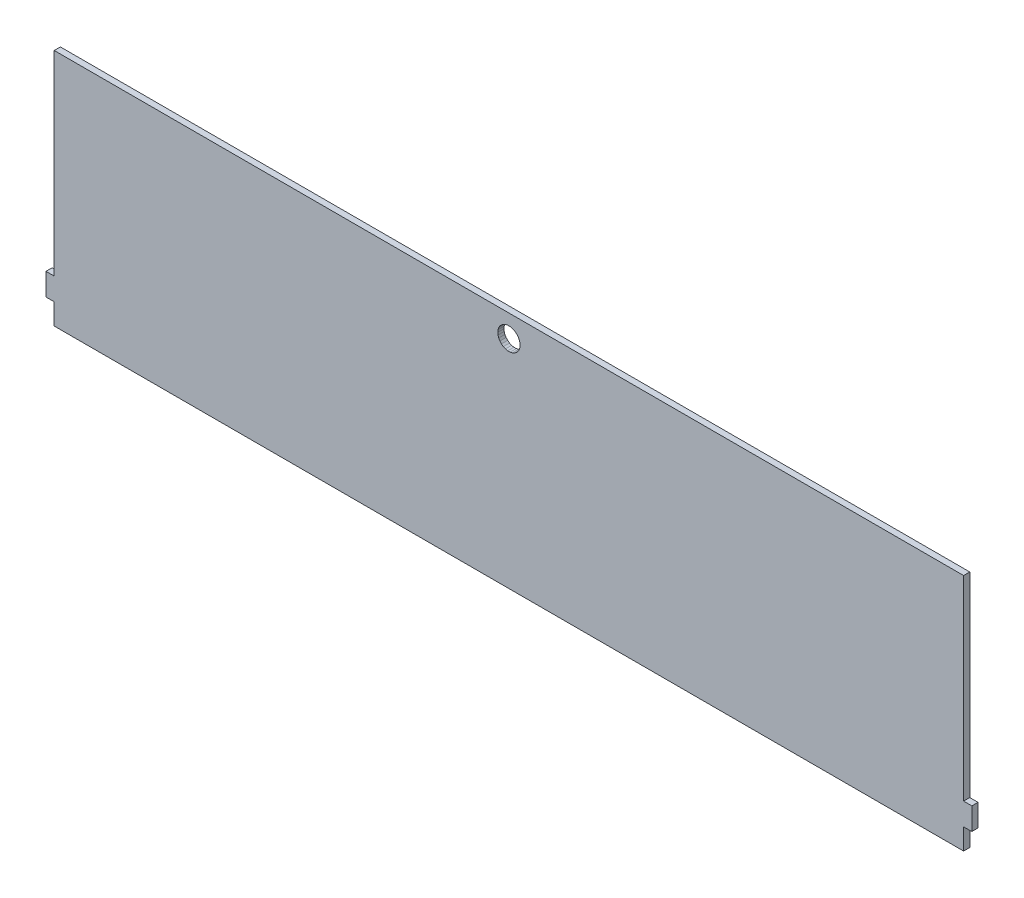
ISO-10303-21;
HEADER;
FILE_DESCRIPTION(('STEP AP214'),'2;1');
FILE_NAME('part.step','',(''),(''),'','','');
FILE_SCHEMA(('AUTOMOTIVE_DESIGN { 1 0 10303 214 1 1 1 1 }'));
ENDSEC;
DATA;
#1=APPLICATION_CONTEXT('core data for automotive mechanical design processes');
#2=APPLICATION_PROTOCOL_DEFINITION('international standard','automotive_design',2000,#1);
#3=PRODUCT_CONTEXT('',#1,'mechanical');
#4=PRODUCT('Part','Part','',(#3));
#5=PRODUCT_RELATED_PRODUCT_CATEGORY('part','',(#4));
#6=PRODUCT_DEFINITION_FORMATION('','',#4);
#7=PRODUCT_DEFINITION_CONTEXT('part definition',#1,'design');
#8=PRODUCT_DEFINITION('design','',#6,#7);
#9=PRODUCT_DEFINITION_SHAPE('','',#8);
#10=(LENGTH_UNIT() NAMED_UNIT(*) SI_UNIT(.MILLI.,.METRE.));
#11=(NAMED_UNIT(*) PLANE_ANGLE_UNIT() SI_UNIT($,.RADIAN.));
#12=(NAMED_UNIT(*) SI_UNIT($,.STERADIAN.) SOLID_ANGLE_UNIT());
#13=UNCERTAINTY_MEASURE_WITH_UNIT(LENGTH_MEASURE(1.E-05),#10,'distance_accuracy_value','');
#14=(GEOMETRIC_REPRESENTATION_CONTEXT(3) GLOBAL_UNCERTAINTY_ASSIGNED_CONTEXT((#13)) GLOBAL_UNIT_ASSIGNED_CONTEXT((#10,
#11,#12)) REPRESENTATION_CONTEXT('',''));
#15=CARTESIAN_POINT('',(0.,0.,0.));
#16=DIRECTION('',(0.,0.,1.));
#17=DIRECTION('',(1.,0.,0.));
#18=AXIS2_PLACEMENT_3D('',#15,#16,#17);
#19=CARTESIAN_POINT('',(0.,0.,12.));
#20=DIRECTION('',(0.,0.,-1.));
#21=DIRECTION('',(-1.,0.,0.));
#22=AXIS2_PLACEMENT_3D('',#19,#20,#21);
#23=PLANE('',#22);
#24=DIRECTION('',(0.,1.,0.));
#25=VECTOR('',#24,1.);
#26=CARTESIAN_POINT('',(1648.8,611.8,12.));
#27=LINE('',#26,#25);
#28=CARTESIAN_POINT('',(1648.8,611.8,12.));
#29=VERTEX_POINT('',#28);
#30=CARTESIAN_POINT('',(1648.8,652.67,12.));
#31=VERTEX_POINT('',#30);
#32=EDGE_CURVE('E523',#29,#31,#27,.T.);
#33=ORIENTED_EDGE('',*,*,#32,.T.);
#34=DIRECTION('',(1.,0.,0.));
#35=VECTOR('',#34,1.);
#36=CARTESIAN_POINT('',(1648.8,652.67,12.));
#37=LINE('',#36,#35);
#38=CARTESIAN_POINT('',(1664.8,652.67,12.));
#39=VERTEX_POINT('',#38);
#40=EDGE_CURVE('E526',#31,#39,#37,.T.);
#41=ORIENTED_EDGE('',*,*,#40,.T.);
#42=DIRECTION('',(0.,1.,0.));
#43=VECTOR('',#42,1.);
#44=CARTESIAN_POINT('',(1664.8,652.67,12.));
#45=LINE('',#44,#43);
#46=CARTESIAN_POINT('',(1664.8,695.942,12.));
#47=VERTEX_POINT('',#46);
#48=EDGE_CURVE('E529',#39,#47,#45,.T.);
#49=ORIENTED_EDGE('',*,*,#48,.T.);
#50=DIRECTION('',(-1.,0.,0.));
#51=VECTOR('',#50,1.);
#52=CARTESIAN_POINT('',(1664.8,695.942,12.));
#53=LINE('',#52,#51);
#54=CARTESIAN_POINT('',(1648.8,695.942,12.));
#55=VERTEX_POINT('',#54);
#56=EDGE_CURVE('E531',#47,#55,#53,.T.);
#57=ORIENTED_EDGE('',*,*,#56,.T.);
#58=DIRECTION('',(0.,1.,0.));
#59=VECTOR('',#58,1.);
#60=CARTESIAN_POINT('',(1648.8,695.942,12.));
#61=LINE('',#60,#59);
#62=CARTESIAN_POINT('',(1648.8,1075.802,12.));
#63=VERTEX_POINT('',#62);
#64=EDGE_CURVE('E533',#55,#63,#61,.T.);
#65=ORIENTED_EDGE('',*,*,#64,.T.);
#66=DIRECTION('',(-1.,0.,0.));
#67=VECTOR('',#66,1.);
#68=CARTESIAN_POINT('',(1648.8,1075.802,12.));
#69=LINE('',#68,#67);
#70=CARTESIAN_POINT('',(-119.2,1075.802,12.));
#71=VERTEX_POINT('',#70);
#72=EDGE_CURVE('E535',#63,#71,#69,.T.);
#73=ORIENTED_EDGE('',*,*,#72,.T.);
#74=DIRECTION('',(0.,-1.,0.));
#75=VECTOR('',#74,1.);
#76=CARTESIAN_POINT('',(-119.2,1075.802,12.));
#77=LINE('',#76,#75);
#78=CARTESIAN_POINT('',(-119.2,695.942,12.));
#79=VERTEX_POINT('',#78);
#80=EDGE_CURVE('E537',#71,#79,#77,.T.);
#81=ORIENTED_EDGE('',*,*,#80,.T.);
#82=DIRECTION('',(-1.,0.,0.));
#83=VECTOR('',#82,1.);
#84=CARTESIAN_POINT('',(-119.2,695.942,12.));
#85=LINE('',#84,#83);
#86=CARTESIAN_POINT('',(-135.2,695.942,12.));
#87=VERTEX_POINT('',#86);
#88=EDGE_CURVE('E539',#79,#87,#85,.T.);
#89=ORIENTED_EDGE('',*,*,#88,.T.);
#90=DIRECTION('',(0.,-1.,0.));
#91=VECTOR('',#90,1.);
#92=CARTESIAN_POINT('',(-135.2,695.942,12.));
#93=LINE('',#92,#91);
#94=CARTESIAN_POINT('',(-135.2,652.67,12.));
#95=VERTEX_POINT('',#94);
#96=EDGE_CURVE('E541',#87,#95,#93,.T.);
#97=ORIENTED_EDGE('',*,*,#96,.T.);
#98=DIRECTION('',(1.,0.,0.));
#99=VECTOR('',#98,1.);
#100=CARTESIAN_POINT('',(-135.2,652.67,12.));
#101=LINE('',#100,#99);
#102=CARTESIAN_POINT('',(-119.2,652.67,12.));
#103=VERTEX_POINT('',#102);
#104=EDGE_CURVE('E543',#95,#103,#101,.T.);
#105=ORIENTED_EDGE('',*,*,#104,.T.);
#106=DIRECTION('',(0.,-1.,0.));
#107=VECTOR('',#106,1.);
#108=CARTESIAN_POINT('',(-119.2,652.67,12.));
#109=LINE('',#108,#107);
#110=CARTESIAN_POINT('',(-119.2,611.8,12.));
#111=VERTEX_POINT('',#110);
#112=EDGE_CURVE('E545',#103,#111,#109,.T.);
#113=ORIENTED_EDGE('',*,*,#112,.T.);
#114=DIRECTION('',(1.,0.,0.));
#115=VECTOR('',#114,1.);
#116=CARTESIAN_POINT('',(-119.2,611.8,12.));
#117=LINE('',#116,#115);
#118=EDGE_CURVE('E547',#111,#29,#117,.T.);
#119=ORIENTED_EDGE('',*,*,#118,.T.);
#120=EDGE_LOOP('',(#33,#41,#49,#57,#65,#73,#81,#89,#97,#105,#113,#119));
#121=FACE_BOUND('',#120,.T.);
#122=DIRECTION('',(1.,0.,0.));
#123=VECTOR('',#122,1.);
#124=CARTESIAN_POINT('',(767.06,1011.009,12.));
#125=LINE('',#124,#123);
#126=CARTESIAN_POINT('',(762.54,1011.009,12.));
#127=VERTEX_POINT('',#126);
#128=CARTESIAN_POINT('',(767.06,1011.009,12.));
#129=VERTEX_POINT('',#128);
#130=EDGE_CURVE('E304',#127,#129,#125,.T.);
#131=ORIENTED_EDGE('',*,*,#130,.F.);
#132=DIRECTION('',(0.97817568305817,-0.207779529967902,0.));
#133=VECTOR('',#132,1.);
#134=CARTESIAN_POINT('',(762.54,1011.009,12.));
#135=LINE('',#134,#133);
#136=CARTESIAN_POINT('',(758.11,1011.95,12.));
#137=VERTEX_POINT('',#136);
#138=EDGE_CURVE('E381',#137,#127,#135,.T.);
#139=ORIENTED_EDGE('',*,*,#138,.F.);
#140=DIRECTION('',(0.913446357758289,-0.406959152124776,0.));
#141=VECTOR('',#140,1.);
#142=CARTESIAN_POINT('',(758.11,1011.95,12.));
#143=LINE('',#142,#141);
#144=CARTESIAN_POINT('',(753.98,1013.79,12.));
#145=VERTEX_POINT('',#144);
#146=EDGE_CURVE('E379',#145,#137,#143,.T.);
#147=ORIENTED_EDGE('',*,*,#146,.F.);
#148=DIRECTION('',(0.809137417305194,-0.587619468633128,0.));
#149=VECTOR('',#148,1.);
#150=CARTESIAN_POINT('',(753.98,1013.79,12.));
#151=LINE('',#150,#149);
#152=CARTESIAN_POINT('',(750.32,1016.448,12.));
#153=VERTEX_POINT('',#152);
#154=EDGE_CURVE('E377',#153,#145,#151,.T.);
#155=ORIENTED_EDGE('',*,*,#154,.F.);
#156=DIRECTION('',(0.668255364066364,-0.743931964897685,0.));
#157=VECTOR('',#156,1.);
#158=CARTESIAN_POINT('',(750.32,1016.448,12.));
#159=LINE('',#158,#157);
#160=CARTESIAN_POINT('',(747.3,1019.81,12.));
#161=VERTEX_POINT('',#160);
#162=EDGE_CURVE('E375',#161,#153,#159,.T.);
#163=ORIENTED_EDGE('',*,*,#162,.F.);
#164=DIRECTION('',(0.501410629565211,-0.865209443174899,0.));
#165=VECTOR('',#164,1.);
#166=CARTESIAN_POINT('',(747.3,1019.81,12.));
#167=LINE('',#166,#165);
#168=CARTESIAN_POINT('',(745.03,1023.727,12.));
#169=VERTEX_POINT('',#168);
#170=EDGE_CURVE('E373',#169,#161,#167,.T.);
#171=ORIENTED_EDGE('',*,*,#170,.F.);
#172=DIRECTION('',(0.307455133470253,-0.951562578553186,0.));
#173=VECTOR('',#172,1.);
#174=CARTESIAN_POINT('',(745.03,1023.727,12.));
#175=LINE('',#174,#173);
#176=CARTESIAN_POINT('',(743.64,1028.029,12.));
#177=VERTEX_POINT('',#176);
#178=EDGE_CURVE('E371',#177,#169,#175,.T.);
#179=ORIENTED_EDGE('',*,*,#178,.F.);
#180=DIRECTION('',(0.106111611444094,-0.994354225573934,0.));
#181=VECTOR('',#180,1.);
#182=CARTESIAN_POINT('',(743.64,1028.029,12.));
#183=LINE('',#182,#181);
#184=CARTESIAN_POINT('',(743.16,1032.527,12.));
#185=VERTEX_POINT('',#184);
#186=EDGE_CURVE('E369',#185,#177,#183,.T.);
#187=ORIENTED_EDGE('',*,*,#186,.F.);
#188=DIRECTION('',(-0.106088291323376,-0.994356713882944,0.));
#189=VECTOR('',#188,1.);
#190=CARTESIAN_POINT('',(743.16,1032.527,12.));
#191=LINE('',#190,#189);
#192=CARTESIAN_POINT('',(743.64,1037.026,12.));
#193=VERTEX_POINT('',#192);
#194=EDGE_CURVE('E367',#193,#185,#191,.T.);
#195=ORIENTED_EDGE('',*,*,#194,.F.);
#196=DIRECTION('',(-0.307455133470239,-0.951562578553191,0.));
#197=VECTOR('',#196,1.);
#198=CARTESIAN_POINT('',(743.64,1037.026,12.));
#199=LINE('',#198,#197);
#200=CARTESIAN_POINT('',(745.03,1041.328,12.));
#201=VERTEX_POINT('',#200);
#202=EDGE_CURVE('E365',#201,#193,#199,.T.);
#203=ORIENTED_EDGE('',*,*,#202,.F.);
#204=DIRECTION('',(-0.501410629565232,-0.865209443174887,0.));
#205=VECTOR('',#204,1.);
#206=CARTESIAN_POINT('',(745.03,1041.328,12.));
#207=LINE('',#206,#205);
#208=CARTESIAN_POINT('',(747.3,1045.245,12.));
#209=VERTEX_POINT('',#208);
#210=EDGE_CURVE('E363',#209,#201,#207,.T.);
#211=ORIENTED_EDGE('',*,*,#210,.F.);
#212=DIRECTION('',(-0.668365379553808,-0.743833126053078,0.));
#213=VECTOR('',#212,1.);
#214=CARTESIAN_POINT('',(747.3,1045.245,12.));
#215=LINE('',#214,#213);
#216=CARTESIAN_POINT('',(750.32,1048.606,12.));
#217=VERTEX_POINT('',#216);
#218=EDGE_CURVE('E361',#217,#209,#215,.T.);
#219=ORIENTED_EDGE('',*,*,#218,.F.);
#220=DIRECTION('',(-0.809032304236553,-0.587764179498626,0.));
#221=VECTOR('',#220,1.);
#222=CARTESIAN_POINT('',(750.32,1048.606,12.));
#223=LINE('',#222,#221);
#224=CARTESIAN_POINT('',(753.98,1051.265,12.));
#225=VERTEX_POINT('',#224);
#226=EDGE_CURVE('E359',#225,#217,#223,.T.);
#227=ORIENTED_EDGE('',*,*,#226,.F.);
#228=DIRECTION('',(-0.913446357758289,-0.406959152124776,0.));
#229=VECTOR('',#228,1.);
#230=CARTESIAN_POINT('',(753.98,1051.265,12.));
#231=LINE('',#230,#229);
#232=CARTESIAN_POINT('',(758.11,1053.105,12.));
#233=VERTEX_POINT('',#232);
#234=EDGE_CURVE('E357',#233,#225,#231,.T.);
#235=ORIENTED_EDGE('',*,*,#234,.F.);
#236=DIRECTION('',(-0.978220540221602,-0.207568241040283,0.));
#237=VECTOR('',#236,1.);
#238=CARTESIAN_POINT('',(758.11,1053.105,12.));
#239=LINE('',#238,#237);
#240=CARTESIAN_POINT('',(762.54,1054.045,12.));
#241=VERTEX_POINT('',#240);
#242=EDGE_CURVE('E355',#241,#233,#239,.T.);
#243=ORIENTED_EDGE('',*,*,#242,.F.);
#244=DIRECTION('',(-1.,0.,0.));
#245=VECTOR('',#244,1.);
#246=CARTESIAN_POINT('',(762.54,1054.045,12.));
#247=LINE('',#246,#245);
#248=CARTESIAN_POINT('',(767.06,1054.045,12.));
#249=VERTEX_POINT('',#248);
#250=EDGE_CURVE('E353',#249,#241,#247,.T.);
#251=ORIENTED_EDGE('',*,*,#250,.F.);
#252=DIRECTION('',(-0.978220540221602,0.207568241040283,0.));
#253=VECTOR('',#252,1.);
#254=CARTESIAN_POINT('',(767.06,1054.045,12.));
#255=LINE('',#254,#253);
#256=CARTESIAN_POINT('',(771.49,1053.105,12.));
#257=VERTEX_POINT('',#256);
#258=EDGE_CURVE('E351',#257,#249,#255,.T.);
#259=ORIENTED_EDGE('',*,*,#258,.F.);
#260=DIRECTION('',(-0.913446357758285,0.406959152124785,0.));
#261=VECTOR('',#260,1.);
#262=CARTESIAN_POINT('',(771.49,1053.105,12.));
#263=LINE('',#262,#261);
#264=CARTESIAN_POINT('',(775.62,1051.265,12.));
#265=VERTEX_POINT('',#264);
#266=EDGE_CURVE('E349',#265,#257,#263,.T.);
#267=ORIENTED_EDGE('',*,*,#266,.F.);
#268=DIRECTION('',(-0.809032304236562,0.587764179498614,0.));
#269=VECTOR('',#268,1.);
#270=CARTESIAN_POINT('',(775.62,1051.265,12.));
#271=LINE('',#270,#269);
#272=CARTESIAN_POINT('',(779.28,1048.606,12.));
#273=VERTEX_POINT('',#272);
#274=EDGE_CURVE('E347',#273,#265,#271,.T.);
#275=ORIENTED_EDGE('',*,*,#274,.F.);
#276=DIRECTION('',(-0.668365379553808,0.743833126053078,0.));
#277=VECTOR('',#276,1.);
#278=CARTESIAN_POINT('',(779.28,1048.606,12.));
#279=LINE('',#278,#277);
#280=CARTESIAN_POINT('',(782.3,1045.245,12.));
#281=VERTEX_POINT('',#280);
#282=EDGE_CURVE('E345',#281,#273,#279,.T.);
#283=ORIENTED_EDGE('',*,*,#282,.F.);
#284=DIRECTION('',(-0.501410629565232,0.865209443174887,0.));
#285=VECTOR('',#284,1.);
#286=CARTESIAN_POINT('',(782.3,1045.245,12.));
#287=LINE('',#286,#285);
#288=CARTESIAN_POINT('',(784.57,1041.328,12.));
#289=VERTEX_POINT('',#288);
#290=EDGE_CURVE('E343',#289,#281,#287,.T.);
#291=ORIENTED_EDGE('',*,*,#290,.F.);
#292=DIRECTION('',(-0.307455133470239,0.951562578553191,0.));
#293=VECTOR('',#292,1.);
#294=CARTESIAN_POINT('',(784.57,1041.328,12.));
#295=LINE('',#294,#293);
#296=CARTESIAN_POINT('',(785.96,1037.026,12.));
#297=VERTEX_POINT('',#296);
#298=EDGE_CURVE('E341',#297,#289,#295,.T.);
#299=ORIENTED_EDGE('',*,*,#298,.F.);
#300=DIRECTION('',(-0.106088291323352,0.994356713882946,0.));
#301=VECTOR('',#300,1.);
#302=CARTESIAN_POINT('',(785.96,1037.026,12.));
#303=LINE('',#302,#301);
#304=CARTESIAN_POINT('',(786.44,1032.527,12.));
#305=VERTEX_POINT('',#304);
#306=EDGE_CURVE('E339',#305,#297,#303,.T.);
#307=ORIENTED_EDGE('',*,*,#306,.F.);
#308=DIRECTION('',(0.10611161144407,0.994354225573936,0.));
#309=VECTOR('',#308,1.);
#310=CARTESIAN_POINT('',(786.44,1032.527,12.));
#311=LINE('',#310,#309);
#312=CARTESIAN_POINT('',(785.96,1028.029,12.));
#313=VERTEX_POINT('',#312);
#314=EDGE_CURVE('E337',#313,#305,#311,.T.);
#315=ORIENTED_EDGE('',*,*,#314,.F.);
#316=DIRECTION('',(0.307455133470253,0.951562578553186,0.));
#317=VECTOR('',#316,1.);
#318=CARTESIAN_POINT('',(785.96,1028.029,12.));
#319=LINE('',#318,#317);
#320=CARTESIAN_POINT('',(784.57,1023.727,12.));
#321=VERTEX_POINT('',#320);
#322=EDGE_CURVE('E335',#321,#313,#319,.T.);
#323=ORIENTED_EDGE('',*,*,#322,.F.);
#324=DIRECTION('',(0.501410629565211,0.865209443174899,0.));
#325=VECTOR('',#324,1.);
#326=CARTESIAN_POINT('',(784.57,1023.727,12.));
#327=LINE('',#326,#325);
#328=CARTESIAN_POINT('',(782.3,1019.81,12.));
#329=VERTEX_POINT('',#328);
#330=EDGE_CURVE('E333',#329,#321,#327,.T.);
#331=ORIENTED_EDGE('',*,*,#330,.F.);
#332=DIRECTION('',(0.668255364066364,0.743931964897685,0.));
#333=VECTOR('',#332,1.);
#334=CARTESIAN_POINT('',(782.3,1019.81,12.));
#335=LINE('',#334,#333);
#336=CARTESIAN_POINT('',(779.28,1016.448,12.));
#337=VERTEX_POINT('',#336);
#338=EDGE_CURVE('E331',#337,#329,#335,.T.);
#339=ORIENTED_EDGE('',*,*,#338,.F.);
#340=DIRECTION('',(0.809137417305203,0.587619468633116,0.));
#341=VECTOR('',#340,1.);
#342=CARTESIAN_POINT('',(779.28,1016.448,12.));
#343=LINE('',#342,#341);
#344=CARTESIAN_POINT('',(775.62,1013.79,12.));
#345=VERTEX_POINT('',#344);
#346=EDGE_CURVE('E327',#345,#337,#343,.T.);
#347=ORIENTED_EDGE('',*,*,#346,.F.);
#348=DIRECTION('',(0.913446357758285,0.406959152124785,0.));
#349=VECTOR('',#348,1.);
#350=CARTESIAN_POINT('',(775.62,1013.79,12.));
#351=LINE('',#350,#349);
#352=CARTESIAN_POINT('',(771.49,1011.95,12.));
#353=VERTEX_POINT('',#352);
#354=EDGE_CURVE('E325',#353,#345,#351,.T.);
#355=ORIENTED_EDGE('',*,*,#354,.F.);
#356=DIRECTION('',(0.97817568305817,0.207779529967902,0.));
#357=VECTOR('',#356,1.);
#358=CARTESIAN_POINT('',(771.49,1011.95,12.));
#359=LINE('',#358,#357);
#360=EDGE_CURVE('E312',#129,#353,#359,.T.);
#361=ORIENTED_EDGE('',*,*,#360,.F.);
#362=EDGE_LOOP('',(#131,#139,#147,#155,#163,#171,#179,#187,#195,#203,#211,#219,#227,#235,#243,
#251,#259,#267,#275,#283,#291,#299,#307,#315,#323,#331,#339,#347,#355,#361));
#363=FACE_BOUND('',#362,.T.);
#364=ADVANCED_FACE('F35',(#121,#363),#23,.F.);
#365=CARTESIAN_POINT('',(0.,0.,0.));
#366=DIRECTION('',(0.,0.,-1.));
#367=DIRECTION('',(-1.,0.,0.));
#368=AXIS2_PLACEMENT_3D('',#365,#366,#367);
#369=PLANE('',#368);
#370=DIRECTION('',(0.,1.,0.));
#371=VECTOR('',#370,1.);
#372=CARTESIAN_POINT('',(1648.8,611.8,0.));
#373=LINE('',#372,#371);
#374=CARTESIAN_POINT('',(1648.8,611.8,0.));
#375=VERTEX_POINT('',#374);
#376=CARTESIAN_POINT('',(1648.8,652.67,0.));
#377=VERTEX_POINT('',#376);
#378=EDGE_CURVE('E320',#375,#377,#373,.T.);
#379=ORIENTED_EDGE('',*,*,#378,.F.);
#380=DIRECTION('',(1.,0.,0.));
#381=VECTOR('',#380,1.);
#382=CARTESIAN_POINT('',(-119.2,611.8,0.));
#383=LINE('',#382,#381);
#384=CARTESIAN_POINT('',(-119.2,611.8,0.));
#385=VERTEX_POINT('',#384);
#386=EDGE_CURVE('E527',#385,#375,#383,.T.);
#387=ORIENTED_EDGE('',*,*,#386,.F.);
#388=DIRECTION('',(0.,-1.,0.));
#389=VECTOR('',#388,1.);
#390=CARTESIAN_POINT('',(-119.2,652.67,0.));
#391=LINE('',#390,#389);
#392=CARTESIAN_POINT('',(-119.2,652.67,0.));
#393=VERTEX_POINT('',#392);
#394=EDGE_CURVE('E570',#393,#385,#391,.T.);
#395=ORIENTED_EDGE('',*,*,#394,.F.);
#396=DIRECTION('',(1.,0.,0.));
#397=VECTOR('',#396,1.);
#398=CARTESIAN_POINT('',(-135.2,652.67,0.));
#399=LINE('',#398,#397);
#400=CARTESIAN_POINT('',(-135.2,652.67,0.));
#401=VERTEX_POINT('',#400);
#402=EDGE_CURVE('E568',#401,#393,#399,.T.);
#403=ORIENTED_EDGE('',*,*,#402,.F.);
#404=DIRECTION('',(0.,-1.,0.));
#405=VECTOR('',#404,1.);
#406=CARTESIAN_POINT('',(-135.2,695.942,0.));
#407=LINE('',#406,#405);
#408=CARTESIAN_POINT('',(-135.2,695.942,0.));
#409=VERTEX_POINT('',#408);
#410=EDGE_CURVE('E566',#409,#401,#407,.T.);
#411=ORIENTED_EDGE('',*,*,#410,.F.);
#412=DIRECTION('',(-1.,0.,0.));
#413=VECTOR('',#412,1.);
#414=CARTESIAN_POINT('',(-119.2,695.942,0.));
#415=LINE('',#414,#413);
#416=CARTESIAN_POINT('',(-119.2,695.942,0.));
#417=VERTEX_POINT('',#416);
#418=EDGE_CURVE('E564',#417,#409,#415,.T.);
#419=ORIENTED_EDGE('',*,*,#418,.F.);
#420=DIRECTION('',(0.,-1.,0.));
#421=VECTOR('',#420,1.);
#422=CARTESIAN_POINT('',(-119.2,1075.802,0.));
#423=LINE('',#422,#421);
#424=CARTESIAN_POINT('',(-119.2,1075.802,0.));
#425=VERTEX_POINT('',#424);
#426=EDGE_CURVE('E562',#425,#417,#423,.T.);
#427=ORIENTED_EDGE('',*,*,#426,.F.);
#428=DIRECTION('',(-1.,0.,0.));
#429=VECTOR('',#428,1.);
#430=CARTESIAN_POINT('',(1648.8,1075.802,0.));
#431=LINE('',#430,#429);
#432=CARTESIAN_POINT('',(1648.8,1075.802,0.));
#433=VERTEX_POINT('',#432);
#434=EDGE_CURVE('E560',#433,#425,#431,.T.);
#435=ORIENTED_EDGE('',*,*,#434,.F.);
#436=DIRECTION('',(0.,1.,0.));
#437=VECTOR('',#436,1.);
#438=CARTESIAN_POINT('',(1648.8,695.942,0.));
#439=LINE('',#438,#437);
#440=CARTESIAN_POINT('',(1648.8,695.942,0.));
#441=VERTEX_POINT('',#440);
#442=EDGE_CURVE('E558',#441,#433,#439,.T.);
#443=ORIENTED_EDGE('',*,*,#442,.F.);
#444=DIRECTION('',(-1.,0.,0.));
#445=VECTOR('',#444,1.);
#446=CARTESIAN_POINT('',(1664.8,695.942,0.));
#447=LINE('',#446,#445);
#448=CARTESIAN_POINT('',(1664.8,695.942,0.));
#449=VERTEX_POINT('',#448);
#450=EDGE_CURVE('E556',#449,#441,#447,.T.);
#451=ORIENTED_EDGE('',*,*,#450,.F.);
#452=DIRECTION('',(0.,1.,0.));
#453=VECTOR('',#452,1.);
#454=CARTESIAN_POINT('',(1664.8,652.67,0.));
#455=LINE('',#454,#453);
#456=CARTESIAN_POINT('',(1664.8,652.67,0.));
#457=VERTEX_POINT('',#456);
#458=EDGE_CURVE('E554',#457,#449,#455,.T.);
#459=ORIENTED_EDGE('',*,*,#458,.F.);
#460=DIRECTION('',(1.,0.,0.));
#461=VECTOR('',#460,1.);
#462=CARTESIAN_POINT('',(1648.8,652.67,0.));
#463=LINE('',#462,#461);
#464=EDGE_CURVE('E552',#377,#457,#463,.T.);
#465=ORIENTED_EDGE('',*,*,#464,.F.);
#466=EDGE_LOOP('',(#379,#387,#395,#403,#411,#419,#427,#435,#443,#451,#459,#465));
#467=FACE_BOUND('',#466,.T.);
#468=DIRECTION('',(0.97817568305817,-0.207779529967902,0.));
#469=VECTOR('',#468,1.);
#470=CARTESIAN_POINT('',(762.54,1011.009,0.));
#471=LINE('',#470,#469);
#472=CARTESIAN_POINT('',(758.11,1011.95,0.));
#473=VERTEX_POINT('',#472);
#474=CARTESIAN_POINT('',(762.54,1011.009,0.));
#475=VERTEX_POINT('',#474);
#476=EDGE_CURVE('E313',#473,#475,#471,.T.);
#477=ORIENTED_EDGE('',*,*,#476,.T.);
#478=DIRECTION('',(1.,0.,0.));
#479=VECTOR('',#478,1.);
#480=CARTESIAN_POINT('',(767.06,1011.009,0.));
#481=LINE('',#480,#479);
#482=CARTESIAN_POINT('',(767.06,1011.009,0.));
#483=VERTEX_POINT('',#482);
#484=EDGE_CURVE('E58',#475,#483,#481,.T.);
#485=ORIENTED_EDGE('',*,*,#484,.T.);
#486=DIRECTION('',(0.97817568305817,0.207779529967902,0.));
#487=VECTOR('',#486,1.);
#488=CARTESIAN_POINT('',(771.49,1011.95,0.));
#489=LINE('',#488,#487);
#490=CARTESIAN_POINT('',(771.49,1011.95,0.));
#491=VERTEX_POINT('',#490);
#492=EDGE_CURVE('E319',#483,#491,#489,.T.);
#493=ORIENTED_EDGE('',*,*,#492,.T.);
#494=DIRECTION('',(0.913446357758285,0.406959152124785,0.));
#495=VECTOR('',#494,1.);
#496=CARTESIAN_POINT('',(775.62,1013.79,0.));
#497=LINE('',#496,#495);
#498=CARTESIAN_POINT('',(775.62,1013.79,0.));
#499=VERTEX_POINT('',#498);
#500=EDGE_CURVE('E385',#491,#499,#497,.T.);
#501=ORIENTED_EDGE('',*,*,#500,.T.);
#502=DIRECTION('',(0.809137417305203,0.587619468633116,0.));
#503=VECTOR('',#502,1.);
#504=CARTESIAN_POINT('',(779.28,1016.448,0.));
#505=LINE('',#504,#503);
#506=CARTESIAN_POINT('',(779.28,1016.448,0.));
#507=VERTEX_POINT('',#506);
#508=EDGE_CURVE('E388',#499,#507,#505,.T.);
#509=ORIENTED_EDGE('',*,*,#508,.T.);
#510=DIRECTION('',(0.668255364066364,0.743931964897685,0.));
#511=VECTOR('',#510,1.);
#512=CARTESIAN_POINT('',(782.3,1019.81,0.));
#513=LINE('',#512,#511);
#514=CARTESIAN_POINT('',(782.3,1019.81,0.));
#515=VERTEX_POINT('',#514);
#516=EDGE_CURVE('E391',#507,#515,#513,.T.);
#517=ORIENTED_EDGE('',*,*,#516,.T.);
#518=DIRECTION('',(0.501410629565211,0.865209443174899,0.));
#519=VECTOR('',#518,1.);
#520=CARTESIAN_POINT('',(784.57,1023.727,0.));
#521=LINE('',#520,#519);
#522=CARTESIAN_POINT('',(784.57,1023.727,0.));
#523=VERTEX_POINT('',#522);
#524=EDGE_CURVE('E394',#515,#523,#521,.T.);
#525=ORIENTED_EDGE('',*,*,#524,.T.);
#526=DIRECTION('',(0.307455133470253,0.951562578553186,0.));
#527=VECTOR('',#526,1.);
#528=CARTESIAN_POINT('',(785.96,1028.029,0.));
#529=LINE('',#528,#527);
#530=CARTESIAN_POINT('',(785.96,1028.029,0.));
#531=VERTEX_POINT('',#530);
#532=EDGE_CURVE('E397',#523,#531,#529,.T.);
#533=ORIENTED_EDGE('',*,*,#532,.T.);
#534=DIRECTION('',(0.10611161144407,0.994354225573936,0.));
#535=VECTOR('',#534,1.);
#536=CARTESIAN_POINT('',(786.44,1032.527,0.));
#537=LINE('',#536,#535);
#538=CARTESIAN_POINT('',(786.44,1032.527,0.));
#539=VERTEX_POINT('',#538);
#540=EDGE_CURVE('E400',#531,#539,#537,.T.);
#541=ORIENTED_EDGE('',*,*,#540,.T.);
#542=DIRECTION('',(-0.106088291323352,0.994356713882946,0.));
#543=VECTOR('',#542,1.);
#544=CARTESIAN_POINT('',(785.96,1037.026,0.));
#545=LINE('',#544,#543);
#546=CARTESIAN_POINT('',(785.96,1037.026,0.));
#547=VERTEX_POINT('',#546);
#548=EDGE_CURVE('E403',#539,#547,#545,.T.);
#549=ORIENTED_EDGE('',*,*,#548,.T.);
#550=DIRECTION('',(-0.307455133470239,0.951562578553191,0.));
#551=VECTOR('',#550,1.);
#552=CARTESIAN_POINT('',(784.57,1041.328,0.));
#553=LINE('',#552,#551);
#554=CARTESIAN_POINT('',(784.57,1041.328,0.));
#555=VERTEX_POINT('',#554);
#556=EDGE_CURVE('E406',#547,#555,#553,.T.);
#557=ORIENTED_EDGE('',*,*,#556,.T.);
#558=DIRECTION('',(-0.501410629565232,0.865209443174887,0.));
#559=VECTOR('',#558,1.);
#560=CARTESIAN_POINT('',(782.3,1045.245,0.));
#561=LINE('',#560,#559);
#562=CARTESIAN_POINT('',(782.3,1045.245,0.));
#563=VERTEX_POINT('',#562);
#564=EDGE_CURVE('E409',#555,#563,#561,.T.);
#565=ORIENTED_EDGE('',*,*,#564,.T.);
#566=DIRECTION('',(-0.668365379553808,0.743833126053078,0.));
#567=VECTOR('',#566,1.);
#568=CARTESIAN_POINT('',(779.28,1048.606,0.));
#569=LINE('',#568,#567);
#570=CARTESIAN_POINT('',(779.28,1048.606,0.));
#571=VERTEX_POINT('',#570);
#572=EDGE_CURVE('E412',#563,#571,#569,.T.);
#573=ORIENTED_EDGE('',*,*,#572,.T.);
#574=DIRECTION('',(-0.809032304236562,0.587764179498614,0.));
#575=VECTOR('',#574,1.);
#576=CARTESIAN_POINT('',(775.62,1051.265,0.));
#577=LINE('',#576,#575);
#578=CARTESIAN_POINT('',(775.62,1051.265,0.));
#579=VERTEX_POINT('',#578);
#580=EDGE_CURVE('E415',#571,#579,#577,.T.);
#581=ORIENTED_EDGE('',*,*,#580,.T.);
#582=DIRECTION('',(-0.913446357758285,0.406959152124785,0.));
#583=VECTOR('',#582,1.);
#584=CARTESIAN_POINT('',(771.49,1053.105,0.));
#585=LINE('',#584,#583);
#586=CARTESIAN_POINT('',(771.49,1053.105,0.));
#587=VERTEX_POINT('',#586);
#588=EDGE_CURVE('E418',#579,#587,#585,.T.);
#589=ORIENTED_EDGE('',*,*,#588,.T.);
#590=DIRECTION('',(-0.978220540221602,0.207568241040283,0.));
#591=VECTOR('',#590,1.);
#592=CARTESIAN_POINT('',(767.06,1054.045,0.));
#593=LINE('',#592,#591);
#594=CARTESIAN_POINT('',(767.06,1054.045,0.));
#595=VERTEX_POINT('',#594);
#596=EDGE_CURVE('E421',#587,#595,#593,.T.);
#597=ORIENTED_EDGE('',*,*,#596,.T.);
#598=DIRECTION('',(-1.,0.,0.));
#599=VECTOR('',#598,1.);
#600=CARTESIAN_POINT('',(762.54,1054.045,0.));
#601=LINE('',#600,#599);
#602=CARTESIAN_POINT('',(762.54,1054.045,0.));
#603=VERTEX_POINT('',#602);
#604=EDGE_CURVE('E424',#595,#603,#601,.T.);
#605=ORIENTED_EDGE('',*,*,#604,.T.);
#606=DIRECTION('',(-0.978220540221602,-0.207568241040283,0.));
#607=VECTOR('',#606,1.);
#608=CARTESIAN_POINT('',(758.11,1053.105,0.));
#609=LINE('',#608,#607);
#610=CARTESIAN_POINT('',(758.11,1053.105,0.));
#611=VERTEX_POINT('',#610);
#612=EDGE_CURVE('E427',#603,#611,#609,.T.);
#613=ORIENTED_EDGE('',*,*,#612,.T.);
#614=DIRECTION('',(-0.913446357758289,-0.406959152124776,0.));
#615=VECTOR('',#614,1.);
#616=CARTESIAN_POINT('',(753.98,1051.265,0.));
#617=LINE('',#616,#615);
#618=CARTESIAN_POINT('',(753.98,1051.265,0.));
#619=VERTEX_POINT('',#618);
#620=EDGE_CURVE('E430',#611,#619,#617,.T.);
#621=ORIENTED_EDGE('',*,*,#620,.T.);
#622=DIRECTION('',(-0.809032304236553,-0.587764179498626,0.));
#623=VECTOR('',#622,1.);
#624=CARTESIAN_POINT('',(750.32,1048.606,0.));
#625=LINE('',#624,#623);
#626=CARTESIAN_POINT('',(750.32,1048.606,0.));
#627=VERTEX_POINT('',#626);
#628=EDGE_CURVE('E433',#619,#627,#625,.T.);
#629=ORIENTED_EDGE('',*,*,#628,.T.);
#630=DIRECTION('',(-0.668365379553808,-0.743833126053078,0.));
#631=VECTOR('',#630,1.);
#632=CARTESIAN_POINT('',(747.3,1045.245,0.));
#633=LINE('',#632,#631);
#634=CARTESIAN_POINT('',(747.3,1045.245,0.));
#635=VERTEX_POINT('',#634);
#636=EDGE_CURVE('E436',#627,#635,#633,.T.);
#637=ORIENTED_EDGE('',*,*,#636,.T.);
#638=DIRECTION('',(-0.501410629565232,-0.865209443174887,0.));
#639=VECTOR('',#638,1.);
#640=CARTESIAN_POINT('',(745.03,1041.328,0.));
#641=LINE('',#640,#639);
#642=CARTESIAN_POINT('',(745.03,1041.328,0.));
#643=VERTEX_POINT('',#642);
#644=EDGE_CURVE('E439',#635,#643,#641,.T.);
#645=ORIENTED_EDGE('',*,*,#644,.T.);
#646=DIRECTION('',(-0.307455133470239,-0.951562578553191,0.));
#647=VECTOR('',#646,1.);
#648=CARTESIAN_POINT('',(743.64,1037.026,0.));
#649=LINE('',#648,#647);
#650=CARTESIAN_POINT('',(743.64,1037.026,0.));
#651=VERTEX_POINT('',#650);
#652=EDGE_CURVE('E442',#643,#651,#649,.T.);
#653=ORIENTED_EDGE('',*,*,#652,.T.);
#654=DIRECTION('',(-0.106088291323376,-0.994356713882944,0.));
#655=VECTOR('',#654,1.);
#656=CARTESIAN_POINT('',(743.16,1032.527,0.));
#657=LINE('',#656,#655);
#658=CARTESIAN_POINT('',(743.16,1032.527,0.));
#659=VERTEX_POINT('',#658);
#660=EDGE_CURVE('E445',#651,#659,#657,.T.);
#661=ORIENTED_EDGE('',*,*,#660,.T.);
#662=DIRECTION('',(0.106111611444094,-0.994354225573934,0.));
#663=VECTOR('',#662,1.);
#664=CARTESIAN_POINT('',(743.64,1028.029,0.));
#665=LINE('',#664,#663);
#666=CARTESIAN_POINT('',(743.64,1028.029,0.));
#667=VERTEX_POINT('',#666);
#668=EDGE_CURVE('E448',#659,#667,#665,.T.);
#669=ORIENTED_EDGE('',*,*,#668,.T.);
#670=DIRECTION('',(0.307455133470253,-0.951562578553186,0.));
#671=VECTOR('',#670,1.);
#672=CARTESIAN_POINT('',(745.03,1023.727,0.));
#673=LINE('',#672,#671);
#674=CARTESIAN_POINT('',(745.03,1023.727,0.));
#675=VERTEX_POINT('',#674);
#676=EDGE_CURVE('E451',#667,#675,#673,.T.);
#677=ORIENTED_EDGE('',*,*,#676,.T.);
#678=DIRECTION('',(0.501410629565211,-0.865209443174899,0.));
#679=VECTOR('',#678,1.);
#680=CARTESIAN_POINT('',(747.3,1019.81,0.));
#681=LINE('',#680,#679);
#682=CARTESIAN_POINT('',(747.3,1019.81,0.));
#683=VERTEX_POINT('',#682);
#684=EDGE_CURVE('E454',#675,#683,#681,.T.);
#685=ORIENTED_EDGE('',*,*,#684,.T.);
#686=DIRECTION('',(0.668255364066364,-0.743931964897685,0.));
#687=VECTOR('',#686,1.);
#688=CARTESIAN_POINT('',(750.32,1016.448,0.));
#689=LINE('',#688,#687);
#690=CARTESIAN_POINT('',(750.32,1016.448,0.));
#691=VERTEX_POINT('',#690);
#692=EDGE_CURVE('E457',#683,#691,#689,.T.);
#693=ORIENTED_EDGE('',*,*,#692,.T.);
#694=DIRECTION('',(0.809137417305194,-0.587619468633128,0.));
#695=VECTOR('',#694,1.);
#696=CARTESIAN_POINT('',(753.98,1013.79,0.));
#697=LINE('',#696,#695);
#698=CARTESIAN_POINT('',(753.98,1013.79,0.));
#699=VERTEX_POINT('',#698);
#700=EDGE_CURVE('E460',#691,#699,#697,.T.);
#701=ORIENTED_EDGE('',*,*,#700,.T.);
#702=DIRECTION('',(0.913446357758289,-0.406959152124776,0.));
#703=VECTOR('',#702,1.);
#704=CARTESIAN_POINT('',(758.11,1011.95,0.));
#705=LINE('',#704,#703);
#706=EDGE_CURVE('E463',#699,#473,#705,.T.);
#707=ORIENTED_EDGE('',*,*,#706,.T.);
#708=EDGE_LOOP('',(#477,#485,#493,#501,#509,#517,#525,#533,#541,#549,#557,#565,#573,#581,#589,
#597,#605,#613,#621,#629,#637,#645,#653,#661,#669,#677,#685,#693,#701,#707));
#709=FACE_BOUND('',#708,.T.);
#710=ADVANCED_FACE('F612',(#467,#709),#369,.T.);
#711=CARTESIAN_POINT('',(1648.8,611.8,12.));
#712=DIRECTION('',(-1.,0.,0.));
#713=DIRECTION('',(0.,0.,1.));
#714=AXIS2_PLACEMENT_3D('',#711,#712,#713);
#715=PLANE('',#714);
#716=ORIENTED_EDGE('',*,*,#378,.T.);
#717=DIRECTION('',(0.,0.,-1.));
#718=VECTOR('',#717,1.);
#719=CARTESIAN_POINT('',(1648.8,652.67,12.));
#720=LINE('',#719,#718);
#721=EDGE_CURVE('E11',#31,#377,#720,.T.);
#722=ORIENTED_EDGE('',*,*,#721,.F.);
#723=ORIENTED_EDGE('',*,*,#32,.F.);
#724=DIRECTION('',(0.,0.,-1.));
#725=VECTOR('',#724,1.);
#726=CARTESIAN_POINT('',(1648.8,611.8,12.));
#727=LINE('',#726,#725);
#728=EDGE_CURVE('E549',#29,#375,#727,.T.);
#729=ORIENTED_EDGE('',*,*,#728,.T.);
#730=EDGE_LOOP('',(#716,#722,#723,#729));
#731=FACE_BOUND('',#730,.T.);
#732=ADVANCED_FACE('F37',(#731),#715,.F.);
#733=CARTESIAN_POINT('',(1648.8,652.67,12.));
#734=DIRECTION('',(0.,1.,0.));
#735=DIRECTION('',(0.,0.,1.));
#736=AXIS2_PLACEMENT_3D('',#733,#734,#735);
#737=PLANE('',#736);
#738=ORIENTED_EDGE('',*,*,#464,.T.);
#739=DIRECTION('',(0.,0.,-1.));
#740=VECTOR('',#739,1.);
#741=CARTESIAN_POINT('',(1664.8,652.67,12.));
#742=LINE('',#741,#740);
#743=EDGE_CURVE('E43',#39,#457,#742,.T.);
#744=ORIENTED_EDGE('',*,*,#743,.F.);
#745=ORIENTED_EDGE('',*,*,#40,.F.);
#746=ORIENTED_EDGE('',*,*,#721,.T.);
#747=EDGE_LOOP('',(#738,#744,#745,#746));
#748=FACE_BOUND('',#747,.T.);
#749=ADVANCED_FACE('F629',(#748),#737,.F.);
#750=CARTESIAN_POINT('',(1664.8,652.67,12.));
#751=DIRECTION('',(-1.,0.,0.));
#752=DIRECTION('',(0.,0.,1.));
#753=AXIS2_PLACEMENT_3D('',#750,#751,#752);
#754=PLANE('',#753);
#755=ORIENTED_EDGE('',*,*,#458,.T.);
#756=DIRECTION('',(0.,0.,-1.));
#757=VECTOR('',#756,1.);
#758=CARTESIAN_POINT('',(1664.8,695.942,12.));
#759=LINE('',#758,#757);
#760=EDGE_CURVE('E599',#47,#449,#759,.T.);
#761=ORIENTED_EDGE('',*,*,#760,.F.);
#762=ORIENTED_EDGE('',*,*,#48,.F.);
#763=ORIENTED_EDGE('',*,*,#743,.T.);
#764=EDGE_LOOP('',(#755,#761,#762,#763));
#765=FACE_BOUND('',#764,.T.);
#766=ADVANCED_FACE('F606',(#765),#754,.F.);
#767=CARTESIAN_POINT('',(1664.8,695.942,12.));
#768=DIRECTION('',(0.,-1.,0.));
#769=DIRECTION('',(0.,0.,-1.));
#770=AXIS2_PLACEMENT_3D('',#767,#768,#769);
#771=PLANE('',#770);
#772=ORIENTED_EDGE('',*,*,#450,.T.);
#773=DIRECTION('',(0.,0.,-1.));
#774=VECTOR('',#773,1.);
#775=CARTESIAN_POINT('',(1648.8,695.942,12.));
#776=LINE('',#775,#774);
#777=EDGE_CURVE('E596',#55,#441,#776,.T.);
#778=ORIENTED_EDGE('',*,*,#777,.F.);
#779=ORIENTED_EDGE('',*,*,#56,.F.);
#780=ORIENTED_EDGE('',*,*,#760,.T.);
#781=EDGE_LOOP('',(#772,#778,#779,#780));
#782=FACE_BOUND('',#781,.T.);
#783=ADVANCED_FACE('F618',(#782),#771,.F.);
#784=CARTESIAN_POINT('',(1648.8,695.942,12.));
#785=DIRECTION('',(-1.,0.,0.));
#786=DIRECTION('',(0.,0.,1.));
#787=AXIS2_PLACEMENT_3D('',#784,#785,#786);
#788=PLANE('',#787);
#789=ORIENTED_EDGE('',*,*,#442,.T.);
#790=DIRECTION('',(0.,0.,-1.));
#791=VECTOR('',#790,1.);
#792=CARTESIAN_POINT('',(1648.8,1075.802,12.));
#793=LINE('',#792,#791);
#794=EDGE_CURVE('E593',#63,#433,#793,.T.);
#795=ORIENTED_EDGE('',*,*,#794,.F.);
#796=ORIENTED_EDGE('',*,*,#64,.F.);
#797=ORIENTED_EDGE('',*,*,#777,.T.);
#798=EDGE_LOOP('',(#789,#795,#796,#797));
#799=FACE_BOUND('',#798,.T.);
#800=ADVANCED_FACE('F622',(#799),#788,.F.);
#801=CARTESIAN_POINT('',(1648.8,1075.802,12.));
#802=DIRECTION('',(0.,-1.,0.));
#803=DIRECTION('',(0.,0.,-1.));
#804=AXIS2_PLACEMENT_3D('',#801,#802,#803);
#805=PLANE('',#804);
#806=ORIENTED_EDGE('',*,*,#434,.T.);
#807=DIRECTION('',(0.,0.,-1.));
#808=VECTOR('',#807,1.);
#809=CARTESIAN_POINT('',(-119.2,1075.802,12.));
#810=LINE('',#809,#808);
#811=EDGE_CURVE('E590',#71,#425,#810,.T.);
#812=ORIENTED_EDGE('',*,*,#811,.F.);
#813=ORIENTED_EDGE('',*,*,#72,.F.);
#814=ORIENTED_EDGE('',*,*,#794,.T.);
#815=EDGE_LOOP('',(#806,#812,#813,#814));
#816=FACE_BOUND('',#815,.T.);
#817=ADVANCED_FACE('F662',(#816),#805,.F.);
#818=CARTESIAN_POINT('',(-119.2,1075.802,12.));
#819=DIRECTION('',(1.,0.,0.));
#820=DIRECTION('',(0.,0.,-1.));
#821=AXIS2_PLACEMENT_3D('',#818,#819,#820);
#822=PLANE('',#821);
#823=ORIENTED_EDGE('',*,*,#426,.T.);
#824=DIRECTION('',(0.,0.,-1.));
#825=VECTOR('',#824,1.);
#826=CARTESIAN_POINT('',(-119.2,695.942,12.));
#827=LINE('',#826,#825);
#828=EDGE_CURVE('E587',#79,#417,#827,.T.);
#829=ORIENTED_EDGE('',*,*,#828,.F.);
#830=ORIENTED_EDGE('',*,*,#80,.F.);
#831=ORIENTED_EDGE('',*,*,#811,.T.);
#832=EDGE_LOOP('',(#823,#829,#830,#831));
#833=FACE_BOUND('',#832,.T.);
#834=ADVANCED_FACE('F660',(#833),#822,.F.);
#835=CARTESIAN_POINT('',(-119.2,695.942,12.));
#836=DIRECTION('',(0.,-1.,0.));
#837=DIRECTION('',(0.,0.,-1.));
#838=AXIS2_PLACEMENT_3D('',#835,#836,#837);
#839=PLANE('',#838);
#840=ORIENTED_EDGE('',*,*,#418,.T.);
#841=DIRECTION('',(0.,0.,-1.));
#842=VECTOR('',#841,1.);
#843=CARTESIAN_POINT('',(-135.2,695.942,12.));
#844=LINE('',#843,#842);
#845=EDGE_CURVE('E584',#87,#409,#844,.T.);
#846=ORIENTED_EDGE('',*,*,#845,.F.);
#847=ORIENTED_EDGE('',*,*,#88,.F.);
#848=ORIENTED_EDGE('',*,*,#828,.T.);
#849=EDGE_LOOP('',(#840,#846,#847,#848));
#850=FACE_BOUND('',#849,.T.);
#851=ADVANCED_FACE('F656',(#850),#839,.F.);
#852=CARTESIAN_POINT('',(-135.2,695.942,12.));
#853=DIRECTION('',(1.,0.,0.));
#854=DIRECTION('',(0.,0.,-1.));
#855=AXIS2_PLACEMENT_3D('',#852,#853,#854);
#856=PLANE('',#855);
#857=ORIENTED_EDGE('',*,*,#410,.T.);
#858=DIRECTION('',(0.,0.,-1.));
#859=VECTOR('',#858,1.);
#860=CARTESIAN_POINT('',(-135.2,652.67,12.));
#861=LINE('',#860,#859);
#862=EDGE_CURVE('E581',#95,#401,#861,.T.);
#863=ORIENTED_EDGE('',*,*,#862,.F.);
#864=ORIENTED_EDGE('',*,*,#96,.F.);
#865=ORIENTED_EDGE('',*,*,#845,.T.);
#866=EDGE_LOOP('',(#857,#863,#864,#865));
#867=FACE_BOUND('',#866,.T.);
#868=ADVANCED_FACE('F651',(#867),#856,.F.);
#869=CARTESIAN_POINT('',(-135.2,652.67,12.));
#870=DIRECTION('',(0.,1.,0.));
#871=DIRECTION('',(0.,0.,1.));
#872=AXIS2_PLACEMENT_3D('',#869,#870,#871);
#873=PLANE('',#872);
#874=ORIENTED_EDGE('',*,*,#402,.T.);
#875=DIRECTION('',(0.,0.,-1.));
#876=VECTOR('',#875,1.);
#877=CARTESIAN_POINT('',(-119.2,652.67,12.));
#878=LINE('',#877,#876);
#879=EDGE_CURVE('E578',#103,#393,#878,.T.);
#880=ORIENTED_EDGE('',*,*,#879,.F.);
#881=ORIENTED_EDGE('',*,*,#104,.F.);
#882=ORIENTED_EDGE('',*,*,#862,.T.);
#883=EDGE_LOOP('',(#874,#880,#881,#882));
#884=FACE_BOUND('',#883,.T.);
#885=ADVANCED_FACE('F645',(#884),#873,.F.);
#886=CARTESIAN_POINT('',(-119.2,652.67,12.));
#887=DIRECTION('',(1.,0.,0.));
#888=DIRECTION('',(0.,0.,-1.));
#889=AXIS2_PLACEMENT_3D('',#886,#887,#888);
#890=PLANE('',#889);
#891=ORIENTED_EDGE('',*,*,#394,.T.);
#892=DIRECTION('',(0.,0.,-1.));
#893=VECTOR('',#892,1.);
#894=CARTESIAN_POINT('',(-119.2,611.8,12.));
#895=LINE('',#894,#893);
#896=EDGE_CURVE('E575',#111,#385,#895,.T.);
#897=ORIENTED_EDGE('',*,*,#896,.F.);
#898=ORIENTED_EDGE('',*,*,#112,.F.);
#899=ORIENTED_EDGE('',*,*,#879,.T.);
#900=EDGE_LOOP('',(#891,#897,#898,#899));
#901=FACE_BOUND('',#900,.T.);
#902=ADVANCED_FACE('F641',(#901),#890,.F.);
#903=CARTESIAN_POINT('',(-119.2,611.8,12.));
#904=DIRECTION('',(0.,1.,0.));
#905=DIRECTION('',(0.,0.,1.));
#906=AXIS2_PLACEMENT_3D('',#903,#904,#905);
#907=PLANE('',#906);
#908=ORIENTED_EDGE('',*,*,#386,.T.);
#909=ORIENTED_EDGE('',*,*,#728,.F.);
#910=ORIENTED_EDGE('',*,*,#118,.F.);
#911=ORIENTED_EDGE('',*,*,#896,.T.);
#912=EDGE_LOOP('',(#908,#909,#910,#911));
#913=FACE_BOUND('',#912,.T.);
#914=ADVANCED_FACE('F636',(#913),#907,.F.);
#915=CARTESIAN_POINT('',(767.06,1011.009,12.));
#916=DIRECTION('',(0.,1.,0.));
#917=DIRECTION('',(0.,0.,1.));
#918=AXIS2_PLACEMENT_3D('',#915,#916,#917);
#919=PLANE('',#918);
#920=ORIENTED_EDGE('',*,*,#484,.F.);
#921=DIRECTION('',(0.,0.,-1.));
#922=VECTOR('',#921,1.);
#923=CARTESIAN_POINT('',(762.54,1011.009,12.));
#924=LINE('',#923,#922);
#925=EDGE_CURVE('E308',#127,#475,#924,.T.);
#926=ORIENTED_EDGE('',*,*,#925,.F.);
#927=ORIENTED_EDGE('',*,*,#130,.T.);
#928=DIRECTION('',(0.,0.,-1.));
#929=VECTOR('',#928,1.);
#930=CARTESIAN_POINT('',(767.06,1011.009,12.));
#931=LINE('',#930,#929);
#932=EDGE_CURVE('E307',#129,#483,#931,.T.);
#933=ORIENTED_EDGE('',*,*,#932,.T.);
#934=EDGE_LOOP('',(#920,#926,#927,#933));
#935=FACE_BOUND('',#934,.T.);
#936=ADVANCED_FACE('F306',(#935),#919,.T.);
#937=CARTESIAN_POINT('',(771.49,1011.95,12.));
#938=DIRECTION('',(-0.207779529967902,0.97817568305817,0.));
#939=DIRECTION('',(-0.97817568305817,-0.207779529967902,0.));
#940=AXIS2_PLACEMENT_3D('',#937,#938,#939);
#941=PLANE('',#940);
#942=ORIENTED_EDGE('',*,*,#492,.F.);
#943=ORIENTED_EDGE('',*,*,#932,.F.);
#944=ORIENTED_EDGE('',*,*,#360,.T.);
#945=DIRECTION('',(0.,0.,-1.));
#946=VECTOR('',#945,1.);
#947=CARTESIAN_POINT('',(771.49,1011.95,12.));
#948=LINE('',#947,#946);
#949=EDGE_CURVE('E321',#353,#491,#948,.T.);
#950=ORIENTED_EDGE('',*,*,#949,.T.);
#951=EDGE_LOOP('',(#942,#943,#944,#950));
#952=FACE_BOUND('',#951,.T.);
#953=ADVANCED_FACE('F316',(#952),#941,.T.);
#954=CARTESIAN_POINT('',(775.62,1013.79,12.));
#955=DIRECTION('',(-0.406959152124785,0.913446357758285,0.));
#956=DIRECTION('',(-0.913446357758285,-0.406959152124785,0.));
#957=AXIS2_PLACEMENT_3D('',#954,#955,#956);
#958=PLANE('',#957);
#959=ORIENTED_EDGE('',*,*,#500,.F.);
#960=ORIENTED_EDGE('',*,*,#949,.F.);
#961=ORIENTED_EDGE('',*,*,#354,.T.);
#962=DIRECTION('',(0.,0.,-1.));
#963=VECTOR('',#962,1.);
#964=CARTESIAN_POINT('',(775.62,1013.79,12.));
#965=LINE('',#964,#963);
#966=EDGE_CURVE('E520',#345,#499,#965,.T.);
#967=ORIENTED_EDGE('',*,*,#966,.T.);
#968=EDGE_LOOP('',(#959,#960,#961,#967));
#969=FACE_BOUND('',#968,.T.);
#970=ADVANCED_FACE('F720',(#969),#958,.T.);
#971=CARTESIAN_POINT('',(779.28,1016.448,12.));
#972=DIRECTION('',(-0.587619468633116,0.809137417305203,0.));
#973=DIRECTION('',(-0.809137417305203,-0.587619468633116,0.));
#974=AXIS2_PLACEMENT_3D('',#971,#972,#973);
#975=PLANE('',#974);
#976=ORIENTED_EDGE('',*,*,#508,.F.);
#977=ORIENTED_EDGE('',*,*,#966,.F.);
#978=ORIENTED_EDGE('',*,*,#346,.T.);
#979=DIRECTION('',(0.,0.,-1.));
#980=VECTOR('',#979,1.);
#981=CARTESIAN_POINT('',(779.28,1016.448,12.));
#982=LINE('',#981,#980);
#983=EDGE_CURVE('E518',#337,#507,#982,.T.);
#984=ORIENTED_EDGE('',*,*,#983,.T.);
#985=EDGE_LOOP('',(#976,#977,#978,#984));
#986=FACE_BOUND('',#985,.T.);
#987=ADVANCED_FACE('F726',(#986),#975,.T.);
#988=CARTESIAN_POINT('',(782.3,1019.81,12.));
#989=DIRECTION('',(-0.743931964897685,0.668255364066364,0.));
#990=DIRECTION('',(-0.668255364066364,-0.743931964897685,0.));
#991=AXIS2_PLACEMENT_3D('',#988,#989,#990);
#992=PLANE('',#991);
#993=ORIENTED_EDGE('',*,*,#516,.F.);
#994=ORIENTED_EDGE('',*,*,#983,.F.);
#995=ORIENTED_EDGE('',*,*,#338,.T.);
#996=DIRECTION('',(0.,0.,-1.));
#997=VECTOR('',#996,1.);
#998=CARTESIAN_POINT('',(782.3,1019.81,12.));
#999=LINE('',#998,#997);
#1000=EDGE_CURVE('E516',#329,#515,#999,.T.);
#1001=ORIENTED_EDGE('',*,*,#1000,.T.);
#1002=EDGE_LOOP('',(#993,#994,#995,#1001));
#1003=FACE_BOUND('',#1002,.T.);
#1004=ADVANCED_FACE('F734',(#1003),#992,.T.);
#1005=CARTESIAN_POINT('',(784.57,1023.727,12.));
#1006=DIRECTION('',(-0.865209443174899,0.501410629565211,0.));
#1007=DIRECTION('',(-0.501410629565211,-0.865209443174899,0.));
#1008=AXIS2_PLACEMENT_3D('',#1005,#1006,#1007);
#1009=PLANE('',#1008);
#1010=ORIENTED_EDGE('',*,*,#524,.F.);
#1011=ORIENTED_EDGE('',*,*,#1000,.F.);
#1012=ORIENTED_EDGE('',*,*,#330,.T.);
#1013=DIRECTION('',(0.,0.,-1.));
#1014=VECTOR('',#1013,1.);
#1015=CARTESIAN_POINT('',(784.57,1023.727,12.));
#1016=LINE('',#1015,#1014);
#1017=EDGE_CURVE('E514',#321,#523,#1016,.T.);
#1018=ORIENTED_EDGE('',*,*,#1017,.T.);
#1019=EDGE_LOOP('',(#1010,#1011,#1012,#1018));
#1020=FACE_BOUND('',#1019,.T.);
#1021=ADVANCED_FACE('F742',(#1020),#1009,.T.);
#1022=CARTESIAN_POINT('',(785.96,1028.029,12.));
#1023=DIRECTION('',(-0.951562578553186,0.307455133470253,0.));
#1024=DIRECTION('',(-0.307455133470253,-0.951562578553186,0.));
#1025=AXIS2_PLACEMENT_3D('',#1022,#1023,#1024);
#1026=PLANE('',#1025);
#1027=ORIENTED_EDGE('',*,*,#532,.F.);
#1028=ORIENTED_EDGE('',*,*,#1017,.F.);
#1029=ORIENTED_EDGE('',*,*,#322,.T.);
#1030=DIRECTION('',(0.,0.,-1.));
#1031=VECTOR('',#1030,1.);
#1032=CARTESIAN_POINT('',(785.96,1028.029,12.));
#1033=LINE('',#1032,#1031);
#1034=EDGE_CURVE('E512',#313,#531,#1033,.T.);
#1035=ORIENTED_EDGE('',*,*,#1034,.T.);
#1036=EDGE_LOOP('',(#1027,#1028,#1029,#1035));
#1037=FACE_BOUND('',#1036,.T.);
#1038=ADVANCED_FACE('F750',(#1037),#1026,.T.);
#1039=CARTESIAN_POINT('',(786.44,1032.527,12.));
#1040=DIRECTION('',(-0.994354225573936,0.10611161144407,0.));
#1041=DIRECTION('',(-0.10611161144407,-0.994354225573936,0.));
#1042=AXIS2_PLACEMENT_3D('',#1039,#1040,#1041);
#1043=PLANE('',#1042);
#1044=ORIENTED_EDGE('',*,*,#540,.F.);
#1045=ORIENTED_EDGE('',*,*,#1034,.F.);
#1046=ORIENTED_EDGE('',*,*,#314,.T.);
#1047=DIRECTION('',(0.,0.,-1.));
#1048=VECTOR('',#1047,1.);
#1049=CARTESIAN_POINT('',(786.44,1032.527,12.));
#1050=LINE('',#1049,#1048);
#1051=EDGE_CURVE('E510',#305,#539,#1050,.T.);
#1052=ORIENTED_EDGE('',*,*,#1051,.T.);
#1053=EDGE_LOOP('',(#1044,#1045,#1046,#1052));
#1054=FACE_BOUND('',#1053,.T.);
#1055=ADVANCED_FACE('F758',(#1054),#1043,.T.);
#1056=CARTESIAN_POINT('',(785.96,1037.026,12.));
#1057=DIRECTION('',(-0.994356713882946,-0.106088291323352,0.));
#1058=DIRECTION('',(0.106088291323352,-0.994356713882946,0.));
#1059=AXIS2_PLACEMENT_3D('',#1056,#1057,#1058);
#1060=PLANE('',#1059);
#1061=ORIENTED_EDGE('',*,*,#548,.F.);
#1062=ORIENTED_EDGE('',*,*,#1051,.F.);
#1063=ORIENTED_EDGE('',*,*,#306,.T.);
#1064=DIRECTION('',(0.,0.,-1.));
#1065=VECTOR('',#1064,1.);
#1066=CARTESIAN_POINT('',(785.96,1037.026,12.));
#1067=LINE('',#1066,#1065);
#1068=EDGE_CURVE('E508',#297,#547,#1067,.T.);
#1069=ORIENTED_EDGE('',*,*,#1068,.T.);
#1070=EDGE_LOOP('',(#1061,#1062,#1063,#1069));
#1071=FACE_BOUND('',#1070,.T.);
#1072=ADVANCED_FACE('F766',(#1071),#1060,.T.);
#1073=CARTESIAN_POINT('',(784.57,1041.328,12.));
#1074=DIRECTION('',(-0.951562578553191,-0.307455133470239,0.));
#1075=DIRECTION('',(0.307455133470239,-0.951562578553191,0.));
#1076=AXIS2_PLACEMENT_3D('',#1073,#1074,#1075);
#1077=PLANE('',#1076);
#1078=ORIENTED_EDGE('',*,*,#556,.F.);
#1079=ORIENTED_EDGE('',*,*,#1068,.F.);
#1080=ORIENTED_EDGE('',*,*,#298,.T.);
#1081=DIRECTION('',(0.,0.,-1.));
#1082=VECTOR('',#1081,1.);
#1083=CARTESIAN_POINT('',(784.57,1041.328,12.));
#1084=LINE('',#1083,#1082);
#1085=EDGE_CURVE('E506',#289,#555,#1084,.T.);
#1086=ORIENTED_EDGE('',*,*,#1085,.T.);
#1087=EDGE_LOOP('',(#1078,#1079,#1080,#1086));
#1088=FACE_BOUND('',#1087,.T.);
#1089=ADVANCED_FACE('F774',(#1088),#1077,.T.);
#1090=CARTESIAN_POINT('',(782.3,1045.245,12.));
#1091=DIRECTION('',(-0.865209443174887,-0.501410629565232,0.));
#1092=DIRECTION('',(0.501410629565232,-0.865209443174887,0.));
#1093=AXIS2_PLACEMENT_3D('',#1090,#1091,#1092);
#1094=PLANE('',#1093);
#1095=ORIENTED_EDGE('',*,*,#564,.F.);
#1096=ORIENTED_EDGE('',*,*,#1085,.F.);
#1097=ORIENTED_EDGE('',*,*,#290,.T.);
#1098=DIRECTION('',(0.,0.,-1.));
#1099=VECTOR('',#1098,1.);
#1100=CARTESIAN_POINT('',(782.3,1045.245,12.));
#1101=LINE('',#1100,#1099);
#1102=EDGE_CURVE('E504',#281,#563,#1101,.T.);
#1103=ORIENTED_EDGE('',*,*,#1102,.T.);
#1104=EDGE_LOOP('',(#1095,#1096,#1097,#1103));
#1105=FACE_BOUND('',#1104,.T.);
#1106=ADVANCED_FACE('F782',(#1105),#1094,.T.);
#1107=CARTESIAN_POINT('',(779.28,1048.606,12.));
#1108=DIRECTION('',(-0.743833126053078,-0.668365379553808,0.));
#1109=DIRECTION('',(0.668365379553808,-0.743833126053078,0.));
#1110=AXIS2_PLACEMENT_3D('',#1107,#1108,#1109);
#1111=PLANE('',#1110);
#1112=ORIENTED_EDGE('',*,*,#572,.F.);
#1113=ORIENTED_EDGE('',*,*,#1102,.F.);
#1114=ORIENTED_EDGE('',*,*,#282,.T.);
#1115=DIRECTION('',(0.,0.,-1.));
#1116=VECTOR('',#1115,1.);
#1117=CARTESIAN_POINT('',(779.28,1048.606,12.));
#1118=LINE('',#1117,#1116);
#1119=EDGE_CURVE('E502',#273,#571,#1118,.T.);
#1120=ORIENTED_EDGE('',*,*,#1119,.T.);
#1121=EDGE_LOOP('',(#1112,#1113,#1114,#1120));
#1122=FACE_BOUND('',#1121,.T.);
#1123=ADVANCED_FACE('F790',(#1122),#1111,.T.);
#1124=CARTESIAN_POINT('',(775.62,1051.265,12.));
#1125=DIRECTION('',(-0.587764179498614,-0.809032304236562,0.));
#1126=DIRECTION('',(0.809032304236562,-0.587764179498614,0.));
#1127=AXIS2_PLACEMENT_3D('',#1124,#1125,#1126);
#1128=PLANE('',#1127);
#1129=ORIENTED_EDGE('',*,*,#580,.F.);
#1130=ORIENTED_EDGE('',*,*,#1119,.F.);
#1131=ORIENTED_EDGE('',*,*,#274,.T.);
#1132=DIRECTION('',(0.,0.,-1.));
#1133=VECTOR('',#1132,1.);
#1134=CARTESIAN_POINT('',(775.62,1051.265,12.));
#1135=LINE('',#1134,#1133);
#1136=EDGE_CURVE('E500',#265,#579,#1135,.T.);
#1137=ORIENTED_EDGE('',*,*,#1136,.T.);
#1138=EDGE_LOOP('',(#1129,#1130,#1131,#1137));
#1139=FACE_BOUND('',#1138,.T.);
#1140=ADVANCED_FACE('F798',(#1139),#1128,.T.);
#1141=CARTESIAN_POINT('',(771.49,1053.105,12.));
#1142=DIRECTION('',(-0.406959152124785,-0.913446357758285,0.));
#1143=DIRECTION('',(0.913446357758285,-0.406959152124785,0.));
#1144=AXIS2_PLACEMENT_3D('',#1141,#1142,#1143);
#1145=PLANE('',#1144);
#1146=ORIENTED_EDGE('',*,*,#588,.F.);
#1147=ORIENTED_EDGE('',*,*,#1136,.F.);
#1148=ORIENTED_EDGE('',*,*,#266,.T.);
#1149=DIRECTION('',(0.,0.,-1.));
#1150=VECTOR('',#1149,1.);
#1151=CARTESIAN_POINT('',(771.49,1053.105,12.));
#1152=LINE('',#1151,#1150);
#1153=EDGE_CURVE('E498',#257,#587,#1152,.T.);
#1154=ORIENTED_EDGE('',*,*,#1153,.T.);
#1155=EDGE_LOOP('',(#1146,#1147,#1148,#1154));
#1156=FACE_BOUND('',#1155,.T.);
#1157=ADVANCED_FACE('F806',(#1156),#1145,.T.);
#1158=CARTESIAN_POINT('',(767.06,1054.045,12.));
#1159=DIRECTION('',(-0.207568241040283,-0.978220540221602,0.));
#1160=DIRECTION('',(0.978220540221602,-0.207568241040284,0.));
#1161=AXIS2_PLACEMENT_3D('',#1158,#1159,#1160);
#1162=PLANE('',#1161);
#1163=ORIENTED_EDGE('',*,*,#596,.F.);
#1164=ORIENTED_EDGE('',*,*,#1153,.F.);
#1165=ORIENTED_EDGE('',*,*,#258,.T.);
#1166=DIRECTION('',(0.,0.,-1.));
#1167=VECTOR('',#1166,1.);
#1168=CARTESIAN_POINT('',(767.06,1054.045,12.));
#1169=LINE('',#1168,#1167);
#1170=EDGE_CURVE('E496',#249,#595,#1169,.T.);
#1171=ORIENTED_EDGE('',*,*,#1170,.T.);
#1172=EDGE_LOOP('',(#1163,#1164,#1165,#1171));
#1173=FACE_BOUND('',#1172,.T.);
#1174=ADVANCED_FACE('F814',(#1173),#1162,.T.);
#1175=CARTESIAN_POINT('',(762.54,1054.045,12.));
#1176=DIRECTION('',(0.,-1.,0.));
#1177=DIRECTION('',(0.,0.,-1.));
#1178=AXIS2_PLACEMENT_3D('',#1175,#1176,#1177);
#1179=PLANE('',#1178);
#1180=ORIENTED_EDGE('',*,*,#604,.F.);
#1181=ORIENTED_EDGE('',*,*,#1170,.F.);
#1182=ORIENTED_EDGE('',*,*,#250,.T.);
#1183=DIRECTION('',(0.,0.,-1.));
#1184=VECTOR('',#1183,1.);
#1185=CARTESIAN_POINT('',(762.54,1054.045,12.));
#1186=LINE('',#1185,#1184);
#1187=EDGE_CURVE('E494',#241,#603,#1186,.T.);
#1188=ORIENTED_EDGE('',*,*,#1187,.T.);
#1189=EDGE_LOOP('',(#1180,#1181,#1182,#1188));
#1190=FACE_BOUND('',#1189,.T.);
#1191=ADVANCED_FACE('F822',(#1190),#1179,.T.);
#1192=CARTESIAN_POINT('',(758.11,1053.105,12.));
#1193=DIRECTION('',(0.207568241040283,-0.978220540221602,0.));
#1194=DIRECTION('',(0.978220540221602,0.207568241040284,0.));
#1195=AXIS2_PLACEMENT_3D('',#1192,#1193,#1194);
#1196=PLANE('',#1195);
#1197=ORIENTED_EDGE('',*,*,#612,.F.);
#1198=ORIENTED_EDGE('',*,*,#1187,.F.);
#1199=ORIENTED_EDGE('',*,*,#242,.T.);
#1200=DIRECTION('',(0.,0.,-1.));
#1201=VECTOR('',#1200,1.);
#1202=CARTESIAN_POINT('',(758.11,1053.105,12.));
#1203=LINE('',#1202,#1201);
#1204=EDGE_CURVE('E492',#233,#611,#1203,.T.);
#1205=ORIENTED_EDGE('',*,*,#1204,.T.);
#1206=EDGE_LOOP('',(#1197,#1198,#1199,#1205));
#1207=FACE_BOUND('',#1206,.T.);
#1208=ADVANCED_FACE('F830',(#1207),#1196,.T.);
#1209=CARTESIAN_POINT('',(753.98,1051.265,12.));
#1210=DIRECTION('',(0.406959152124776,-0.913446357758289,0.));
#1211=DIRECTION('',(0.913446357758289,0.406959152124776,0.));
#1212=AXIS2_PLACEMENT_3D('',#1209,#1210,#1211);
#1213=PLANE('',#1212);
#1214=ORIENTED_EDGE('',*,*,#620,.F.);
#1215=ORIENTED_EDGE('',*,*,#1204,.F.);
#1216=ORIENTED_EDGE('',*,*,#234,.T.);
#1217=DIRECTION('',(0.,0.,-1.));
#1218=VECTOR('',#1217,1.);
#1219=CARTESIAN_POINT('',(753.98,1051.265,12.));
#1220=LINE('',#1219,#1218);
#1221=EDGE_CURVE('E490',#225,#619,#1220,.T.);
#1222=ORIENTED_EDGE('',*,*,#1221,.T.);
#1223=EDGE_LOOP('',(#1214,#1215,#1216,#1222));
#1224=FACE_BOUND('',#1223,.T.);
#1225=ADVANCED_FACE('F838',(#1224),#1213,.T.);
#1226=CARTESIAN_POINT('',(750.32,1048.606,12.));
#1227=DIRECTION('',(0.587764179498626,-0.809032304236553,0.));
#1228=DIRECTION('',(0.809032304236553,0.587764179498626,0.));
#1229=AXIS2_PLACEMENT_3D('',#1226,#1227,#1228);
#1230=PLANE('',#1229);
#1231=ORIENTED_EDGE('',*,*,#628,.F.);
#1232=ORIENTED_EDGE('',*,*,#1221,.F.);
#1233=ORIENTED_EDGE('',*,*,#226,.T.);
#1234=DIRECTION('',(0.,0.,-1.));
#1235=VECTOR('',#1234,1.);
#1236=CARTESIAN_POINT('',(750.32,1048.606,12.));
#1237=LINE('',#1236,#1235);
#1238=EDGE_CURVE('E488',#217,#627,#1237,.T.);
#1239=ORIENTED_EDGE('',*,*,#1238,.T.);
#1240=EDGE_LOOP('',(#1231,#1232,#1233,#1239));
#1241=FACE_BOUND('',#1240,.T.);
#1242=ADVANCED_FACE('F846',(#1241),#1230,.T.);
#1243=CARTESIAN_POINT('',(747.3,1045.245,12.));
#1244=DIRECTION('',(0.743833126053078,-0.668365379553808,0.));
#1245=DIRECTION('',(0.668365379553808,0.743833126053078,0.));
#1246=AXIS2_PLACEMENT_3D('',#1243,#1244,#1245);
#1247=PLANE('',#1246);
#1248=ORIENTED_EDGE('',*,*,#636,.F.);
#1249=ORIENTED_EDGE('',*,*,#1238,.F.);
#1250=ORIENTED_EDGE('',*,*,#218,.T.);
#1251=DIRECTION('',(0.,0.,-1.));
#1252=VECTOR('',#1251,1.);
#1253=CARTESIAN_POINT('',(747.3,1045.245,12.));
#1254=LINE('',#1253,#1252);
#1255=EDGE_CURVE('E486',#209,#635,#1254,.T.);
#1256=ORIENTED_EDGE('',*,*,#1255,.T.);
#1257=EDGE_LOOP('',(#1248,#1249,#1250,#1256));
#1258=FACE_BOUND('',#1257,.T.);
#1259=ADVANCED_FACE('F854',(#1258),#1247,.T.);
#1260=CARTESIAN_POINT('',(745.03,1041.328,12.));
#1261=DIRECTION('',(0.865209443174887,-0.501410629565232,0.));
#1262=DIRECTION('',(0.501410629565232,0.865209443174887,0.));
#1263=AXIS2_PLACEMENT_3D('',#1260,#1261,#1262);
#1264=PLANE('',#1263);
#1265=ORIENTED_EDGE('',*,*,#644,.F.);
#1266=ORIENTED_EDGE('',*,*,#1255,.F.);
#1267=ORIENTED_EDGE('',*,*,#210,.T.);
#1268=DIRECTION('',(0.,0.,-1.));
#1269=VECTOR('',#1268,1.);
#1270=CARTESIAN_POINT('',(745.03,1041.328,12.));
#1271=LINE('',#1270,#1269);
#1272=EDGE_CURVE('E484',#201,#643,#1271,.T.);
#1273=ORIENTED_EDGE('',*,*,#1272,.T.);
#1274=EDGE_LOOP('',(#1265,#1266,#1267,#1273));
#1275=FACE_BOUND('',#1274,.T.);
#1276=ADVANCED_FACE('F862',(#1275),#1264,.T.);
#1277=CARTESIAN_POINT('',(743.64,1037.026,12.));
#1278=DIRECTION('',(0.951562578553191,-0.307455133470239,0.));
#1279=DIRECTION('',(0.307455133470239,0.951562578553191,0.));
#1280=AXIS2_PLACEMENT_3D('',#1277,#1278,#1279);
#1281=PLANE('',#1280);
#1282=ORIENTED_EDGE('',*,*,#652,.F.);
#1283=ORIENTED_EDGE('',*,*,#1272,.F.);
#1284=ORIENTED_EDGE('',*,*,#202,.T.);
#1285=DIRECTION('',(0.,0.,-1.));
#1286=VECTOR('',#1285,1.);
#1287=CARTESIAN_POINT('',(743.64,1037.026,12.));
#1288=LINE('',#1287,#1286);
#1289=EDGE_CURVE('E482',#193,#651,#1288,.T.);
#1290=ORIENTED_EDGE('',*,*,#1289,.T.);
#1291=EDGE_LOOP('',(#1282,#1283,#1284,#1290));
#1292=FACE_BOUND('',#1291,.T.);
#1293=ADVANCED_FACE('F870',(#1292),#1281,.T.);
#1294=CARTESIAN_POINT('',(743.16,1032.527,12.));
#1295=DIRECTION('',(0.994356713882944,-0.106088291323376,0.));
#1296=DIRECTION('',(0.106088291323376,0.994356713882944,0.));
#1297=AXIS2_PLACEMENT_3D('',#1294,#1295,#1296);
#1298=PLANE('',#1297);
#1299=ORIENTED_EDGE('',*,*,#660,.F.);
#1300=ORIENTED_EDGE('',*,*,#1289,.F.);
#1301=ORIENTED_EDGE('',*,*,#194,.T.);
#1302=DIRECTION('',(0.,0.,-1.));
#1303=VECTOR('',#1302,1.);
#1304=CARTESIAN_POINT('',(743.16,1032.527,12.));
#1305=LINE('',#1304,#1303);
#1306=EDGE_CURVE('E480',#185,#659,#1305,.T.);
#1307=ORIENTED_EDGE('',*,*,#1306,.T.);
#1308=EDGE_LOOP('',(#1299,#1300,#1301,#1307));
#1309=FACE_BOUND('',#1308,.T.);
#1310=ADVANCED_FACE('F878',(#1309),#1298,.T.);
#1311=CARTESIAN_POINT('',(743.64,1028.029,12.));
#1312=DIRECTION('',(0.994354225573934,0.106111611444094,0.));
#1313=DIRECTION('',(-0.106111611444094,0.994354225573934,0.));
#1314=AXIS2_PLACEMENT_3D('',#1311,#1312,#1313);
#1315=PLANE('',#1314);
#1316=ORIENTED_EDGE('',*,*,#668,.F.);
#1317=ORIENTED_EDGE('',*,*,#1306,.F.);
#1318=ORIENTED_EDGE('',*,*,#186,.T.);
#1319=DIRECTION('',(0.,0.,-1.));
#1320=VECTOR('',#1319,1.);
#1321=CARTESIAN_POINT('',(743.64,1028.029,12.));
#1322=LINE('',#1321,#1320);
#1323=EDGE_CURVE('E478',#177,#667,#1322,.T.);
#1324=ORIENTED_EDGE('',*,*,#1323,.T.);
#1325=EDGE_LOOP('',(#1316,#1317,#1318,#1324));
#1326=FACE_BOUND('',#1325,.T.);
#1327=ADVANCED_FACE('F886',(#1326),#1315,.T.);
#1328=CARTESIAN_POINT('',(745.03,1023.727,12.));
#1329=DIRECTION('',(0.951562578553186,0.307455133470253,0.));
#1330=DIRECTION('',(-0.307455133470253,0.951562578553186,0.));
#1331=AXIS2_PLACEMENT_3D('',#1328,#1329,#1330);
#1332=PLANE('',#1331);
#1333=ORIENTED_EDGE('',*,*,#676,.F.);
#1334=ORIENTED_EDGE('',*,*,#1323,.F.);
#1335=ORIENTED_EDGE('',*,*,#178,.T.);
#1336=DIRECTION('',(0.,0.,-1.));
#1337=VECTOR('',#1336,1.);
#1338=CARTESIAN_POINT('',(745.03,1023.727,12.));
#1339=LINE('',#1338,#1337);
#1340=EDGE_CURVE('E476',#169,#675,#1339,.T.);
#1341=ORIENTED_EDGE('',*,*,#1340,.T.);
#1342=EDGE_LOOP('',(#1333,#1334,#1335,#1341));
#1343=FACE_BOUND('',#1342,.T.);
#1344=ADVANCED_FACE('F894',(#1343),#1332,.T.);
#1345=CARTESIAN_POINT('',(747.3,1019.81,12.));
#1346=DIRECTION('',(0.865209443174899,0.501410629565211,0.));
#1347=DIRECTION('',(-0.501410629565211,0.865209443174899,0.));
#1348=AXIS2_PLACEMENT_3D('',#1345,#1346,#1347);
#1349=PLANE('',#1348);
#1350=ORIENTED_EDGE('',*,*,#684,.F.);
#1351=ORIENTED_EDGE('',*,*,#1340,.F.);
#1352=ORIENTED_EDGE('',*,*,#170,.T.);
#1353=DIRECTION('',(0.,0.,-1.));
#1354=VECTOR('',#1353,1.);
#1355=CARTESIAN_POINT('',(747.3,1019.81,12.));
#1356=LINE('',#1355,#1354);
#1357=EDGE_CURVE('E474',#161,#683,#1356,.T.);
#1358=ORIENTED_EDGE('',*,*,#1357,.T.);
#1359=EDGE_LOOP('',(#1350,#1351,#1352,#1358));
#1360=FACE_BOUND('',#1359,.T.);
#1361=ADVANCED_FACE('F902',(#1360),#1349,.T.);
#1362=CARTESIAN_POINT('',(750.32,1016.448,12.));
#1363=DIRECTION('',(0.743931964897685,0.668255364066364,0.));
#1364=DIRECTION('',(-0.668255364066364,0.743931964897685,0.));
#1365=AXIS2_PLACEMENT_3D('',#1362,#1363,#1364);
#1366=PLANE('',#1365);
#1367=ORIENTED_EDGE('',*,*,#692,.F.);
#1368=ORIENTED_EDGE('',*,*,#1357,.F.);
#1369=ORIENTED_EDGE('',*,*,#162,.T.);
#1370=DIRECTION('',(0.,0.,-1.));
#1371=VECTOR('',#1370,1.);
#1372=CARTESIAN_POINT('',(750.32,1016.448,12.));
#1373=LINE('',#1372,#1371);
#1374=EDGE_CURVE('E472',#153,#691,#1373,.T.);
#1375=ORIENTED_EDGE('',*,*,#1374,.T.);
#1376=EDGE_LOOP('',(#1367,#1368,#1369,#1375));
#1377=FACE_BOUND('',#1376,.T.);
#1378=ADVANCED_FACE('F910',(#1377),#1366,.T.);
#1379=CARTESIAN_POINT('',(753.98,1013.79,12.));
#1380=DIRECTION('',(0.587619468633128,0.809137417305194,0.));
#1381=DIRECTION('',(-0.809137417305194,0.587619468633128,0.));
#1382=AXIS2_PLACEMENT_3D('',#1379,#1380,#1381);
#1383=PLANE('',#1382);
#1384=ORIENTED_EDGE('',*,*,#700,.F.);
#1385=ORIENTED_EDGE('',*,*,#1374,.F.);
#1386=ORIENTED_EDGE('',*,*,#154,.T.);
#1387=DIRECTION('',(0.,0.,-1.));
#1388=VECTOR('',#1387,1.);
#1389=CARTESIAN_POINT('',(753.98,1013.79,12.));
#1390=LINE('',#1389,#1388);
#1391=EDGE_CURVE('E470',#145,#699,#1390,.T.);
#1392=ORIENTED_EDGE('',*,*,#1391,.T.);
#1393=EDGE_LOOP('',(#1384,#1385,#1386,#1392));
#1394=FACE_BOUND('',#1393,.T.);
#1395=ADVANCED_FACE('F918',(#1394),#1383,.T.);
#1396=CARTESIAN_POINT('',(758.11,1011.95,12.));
#1397=DIRECTION('',(0.406959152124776,0.913446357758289,0.));
#1398=DIRECTION('',(-0.913446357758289,0.406959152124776,0.));
#1399=AXIS2_PLACEMENT_3D('',#1396,#1397,#1398);
#1400=PLANE('',#1399);
#1401=ORIENTED_EDGE('',*,*,#706,.F.);
#1402=ORIENTED_EDGE('',*,*,#1391,.F.);
#1403=ORIENTED_EDGE('',*,*,#146,.T.);
#1404=DIRECTION('',(0.,0.,-1.));
#1405=VECTOR('',#1404,1.);
#1406=CARTESIAN_POINT('',(758.11,1011.95,12.));
#1407=LINE('',#1406,#1405);
#1408=EDGE_CURVE('E50',#137,#473,#1407,.T.);
#1409=ORIENTED_EDGE('',*,*,#1408,.T.);
#1410=EDGE_LOOP('',(#1401,#1402,#1403,#1409));
#1411=FACE_BOUND('',#1410,.T.);
#1412=ADVANCED_FACE('F926',(#1411),#1400,.T.);
#1413=CARTESIAN_POINT('',(762.54,1011.009,12.));
#1414=DIRECTION('',(0.207779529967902,0.97817568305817,0.));
#1415=DIRECTION('',(-0.97817568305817,0.207779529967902,0.));
#1416=AXIS2_PLACEMENT_3D('',#1413,#1414,#1415);
#1417=PLANE('',#1416);
#1418=ORIENTED_EDGE('',*,*,#476,.F.);
#1419=ORIENTED_EDGE('',*,*,#1408,.F.);
#1420=ORIENTED_EDGE('',*,*,#138,.T.);
#1421=ORIENTED_EDGE('',*,*,#925,.T.);
#1422=EDGE_LOOP('',(#1418,#1419,#1420,#1421));
#1423=FACE_BOUND('',#1422,.T.);
#1424=ADVANCED_FACE('F934',(#1423),#1417,.T.);
#1425=CLOSED_SHELL('',(#364,#710,#732,#749,#766,#783,#800,#817,#834,#851,#868,#885,#902,#914,
#936,#953,#970,#987,#1004,#1021,#1038,#1055,#1072,#1089,#1106,#1123,#1140,#1157,#1174,#1191,
#1208,#1225,#1242,#1259,#1276,#1293,#1310,#1327,#1344,#1361,#1378,#1395,#1412,#1424));
#1426=MANIFOLD_SOLID_BREP('B2',#1425);
#1427=ADVANCED_BREP_SHAPE_REPRESENTATION('',(#18,#1426),#14);
#1428=SHAPE_DEFINITION_REPRESENTATION(#9,#1427);
ENDSEC;
END-ISO-10303-21;
